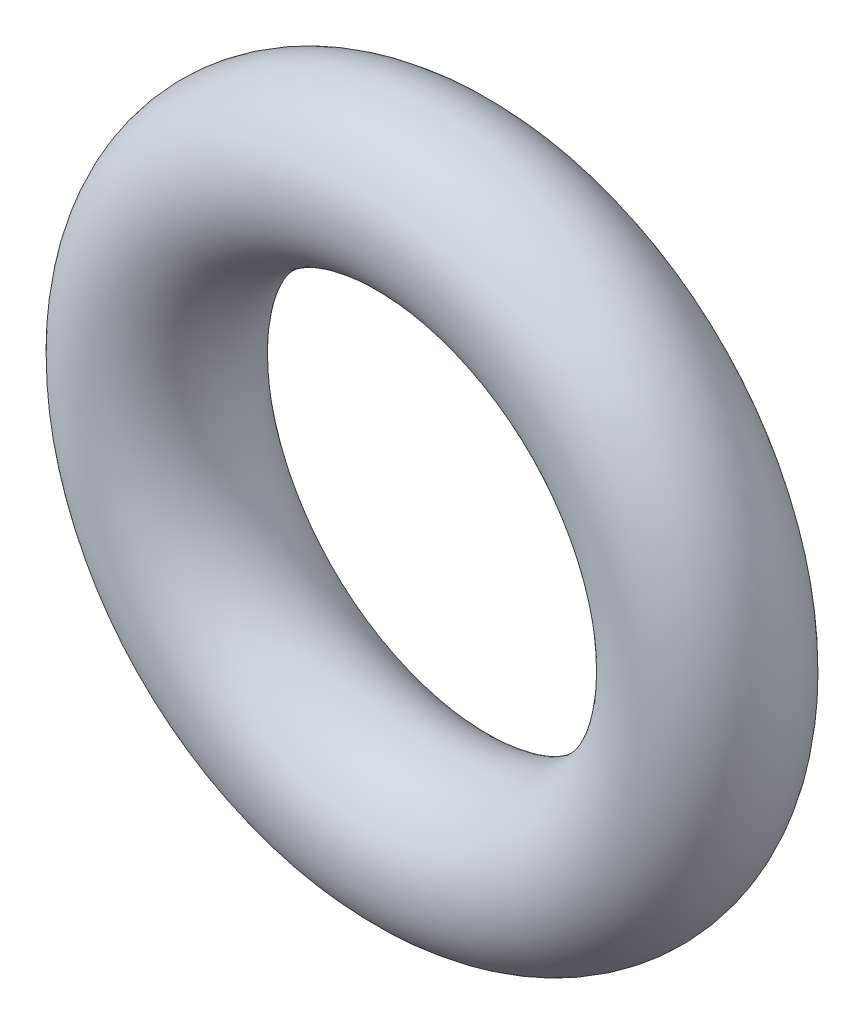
from build123d import *

# Parameters (mm, degrees)
SKETCH1_R = 0.889


with BuildPart() as part:
    # Sketch1 → Revolve1 (revolve)
    with BuildSketch(Plane(origin=(0, 0, 0), x_dir=(0, -1, 0), z_dir=(1, 0, 0)), mode=Mode.PRIVATE) as revolve1_sk:
        with Locations((3.1242, 0)):
            Circle(SKETCH1_R)
    revolve(revolve1_sk.sketch.rotate(Axis((0, 0, 0.889), (0, 0, -1)), 270), axis=Axis((0, 0, 0.889), (0, 0, -1)))


solid = part.part
